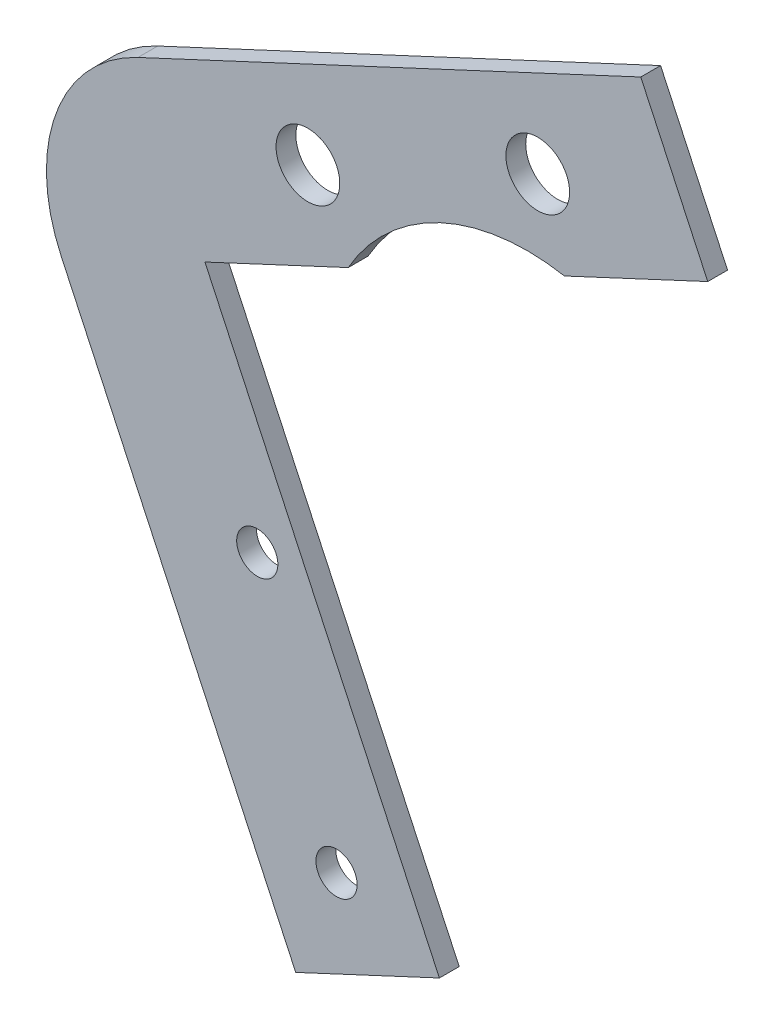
from build123d import *

# Parameters (mm, degrees)
SKETCH1_R      = 1.651
SKETCH1_R_2    = 2.5527
EXTRUDE1_DEPTH = 1.5875


with BuildPart() as part:
    # Sketch1 → Extrude1 (new body)
    with BuildSketch(Plane.XY):
        with BuildLine():
            Line((-12.529168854, 34.91812921), (6.25621288, -5.367251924))
            Line((6.25621288, -5.367251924), (17.766321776, 0))
            Line((17.766321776, 0), (-1.019059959, 40.285381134))
            Line((-1.019059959, 40.285381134), (10.461174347, 45.638702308))
            ThreePointArc((10.461174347, 45.638702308), (17.835490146, 52.440498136), (27.78608687, 53.717441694))
            Line((27.78608687, 53.717441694), (39.266321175, 59.070762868))
            Line((39.266321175, 59.070762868), (33.899069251, 70.580871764))
            Line((33.899069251, 70.580871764), (-6.386311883, 51.795490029))
            ThreePointArc((-6.386311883, 51.795490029), (-12.953156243, 44.629036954), (-12.529168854, 34.91812921))
        make_face()
        with Locations((3.175, 22.225)):
            Circle(SKETCH1_R, mode=Mode.SUBTRACT)
        with Locations((9.525, 3.175)):
            Circle(SKETCH1_R, mode=Mode.SUBTRACT)
        with Locations((25.648091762, 59.726927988)):
            Circle(SKETCH1_R_2, mode=Mode.SUBTRACT)
        with Locations((7.23191753, 51.139324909)):
            Circle(SKETCH1_R_2, mode=Mode.SUBTRACT)
    extrude(amount=EXTRUDE1_DEPTH)


solid = part.part
